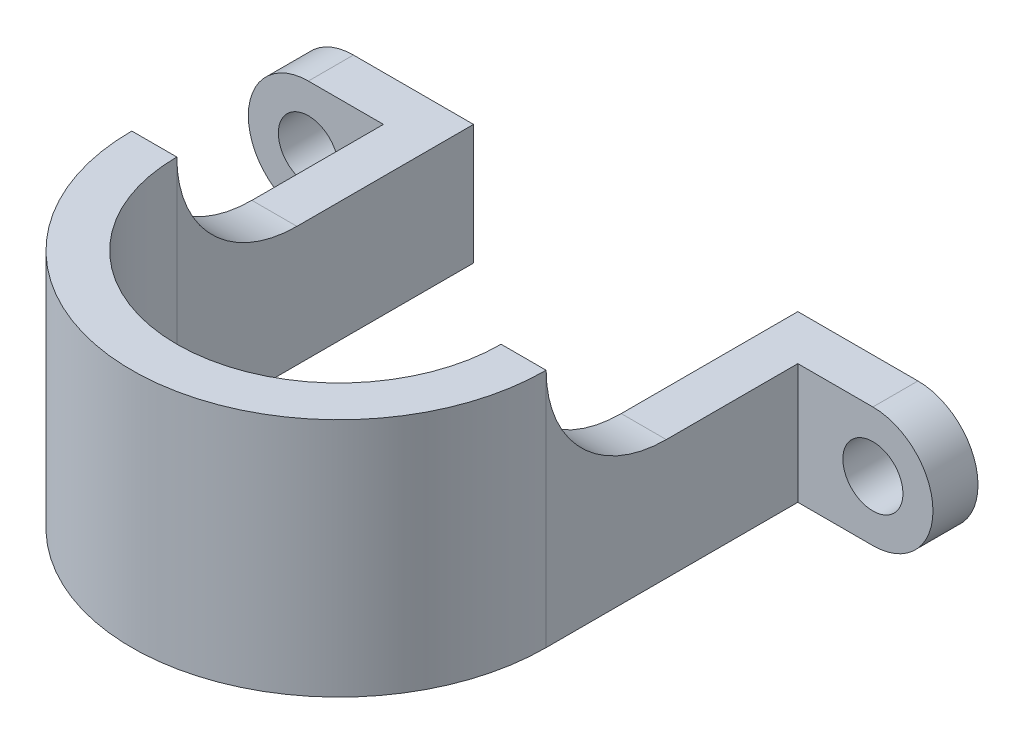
ISO-10303-21;
HEADER;
FILE_DESCRIPTION(('STEP AP214'),'2;1');
FILE_NAME('part.step','',(''),(''),'','','');
FILE_SCHEMA(('AUTOMOTIVE_DESIGN { 1 0 10303 214 1 1 1 1 }'));
ENDSEC;
DATA;
#1=APPLICATION_CONTEXT('core data for automotive mechanical design processes');
#2=APPLICATION_PROTOCOL_DEFINITION('international standard','automotive_design',2000,#1);
#3=PRODUCT_CONTEXT('',#1,'mechanical');
#4=PRODUCT('Part','Part','',(#3));
#5=PRODUCT_RELATED_PRODUCT_CATEGORY('part','',(#4));
#6=PRODUCT_DEFINITION_FORMATION('','',#4);
#7=PRODUCT_DEFINITION_CONTEXT('part definition',#1,'design');
#8=PRODUCT_DEFINITION('design','',#6,#7);
#9=PRODUCT_DEFINITION_SHAPE('','',#8);
#10=(LENGTH_UNIT() NAMED_UNIT(*) SI_UNIT(.MILLI.,.METRE.));
#11=(NAMED_UNIT(*) PLANE_ANGLE_UNIT() SI_UNIT($,.RADIAN.));
#12=(NAMED_UNIT(*) SI_UNIT($,.STERADIAN.) SOLID_ANGLE_UNIT());
#13=UNCERTAINTY_MEASURE_WITH_UNIT(LENGTH_MEASURE(1.E-05),#10,'distance_accuracy_value','');
#14=(GEOMETRIC_REPRESENTATION_CONTEXT(3) GLOBAL_UNCERTAINTY_ASSIGNED_CONTEXT((#13)) GLOBAL_UNIT_ASSIGNED_CONTEXT((#10,
#11,#12)) REPRESENTATION_CONTEXT('',''));
#15=CARTESIAN_POINT('',(0.,0.,0.));
#16=DIRECTION('',(0.,0.,1.));
#17=DIRECTION('',(1.,0.,0.));
#18=AXIS2_PLACEMENT_3D('',#15,#16,#17);
#19=CARTESIAN_POINT('',(366.113193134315,988.729361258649,1255.11303447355));
#20=DIRECTION('',(0.,1.,0.));
#21=DIRECTION('',(-1.,0.,0.));
#22=AXIS2_PLACEMENT_3D('',#19,#20,#21);
#23=PLANE('',#22);
#24=DIRECTION('',(0.,0.,-1.));
#25=VECTOR('',#24,1.);
#26=CARTESIAN_POINT('',(361.350693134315,988.729361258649,1255.11303447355));
#27=LINE('',#26,#25);
#28=CARTESIAN_POINT('',(361.350693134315,988.729361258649,1273.78711447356));
#29=VERTEX_POINT('',#28);
#30=CARTESIAN_POINT('',(361.350693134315,988.729361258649,1259.87553447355));
#31=VERTEX_POINT('',#30);
#32=EDGE_CURVE('E250',#29,#31,#27,.T.);
#33=ORIENTED_EDGE('',*,*,#32,.F.);
#34=DIRECTION('',(-1.,0.,0.));
#35=VECTOR('',#34,1.);
#36=CARTESIAN_POINT('',(366.113193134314,988.729361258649,1273.78711447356));
#37=LINE('',#36,#35);
#38=CARTESIAN_POINT('',(366.113193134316,988.729361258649,1273.78711447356));
#39=VERTEX_POINT('',#38);
#40=EDGE_CURVE('E155',#29,#39,#37,.F.);
#41=ORIENTED_EDGE('',*,*,#40,.T.);
#42=DIRECTION('',(0.,0.,1.));
#43=VECTOR('',#42,1.);
#44=CARTESIAN_POINT('',(366.113193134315,988.729361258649,1255.11303447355));
#45=LINE('',#44,#43);
#46=CARTESIAN_POINT('',(366.113193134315,988.729361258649,1255.11303447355));
#47=VERTEX_POINT('',#46);
#48=EDGE_CURVE('E221',#47,#39,#45,.T.);
#49=ORIENTED_EDGE('',*,*,#48,.F.);
#50=DIRECTION('',(1.,0.,0.));
#51=VECTOR('',#50,1.);
#52=CARTESIAN_POINT('',(366.113193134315,988.729361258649,1255.11303447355));
#53=LINE('',#52,#51);
#54=CARTESIAN_POINT('',(353.413193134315,988.729361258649,1255.11303447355));
#55=VERTEX_POINT('',#54);
#56=EDGE_CURVE('E246',#55,#47,#53,.T.);
#57=ORIENTED_EDGE('',*,*,#56,.F.);
#58=DIRECTION('',(0.,0.,-1.));
#59=VECTOR('',#58,1.);
#60=CARTESIAN_POINT('',(353.413193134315,988.729361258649,1259.87553447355));
#61=LINE('',#60,#59);
#62=CARTESIAN_POINT('',(353.413193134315,988.729361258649,1259.87553447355));
#63=VERTEX_POINT('',#62);
#64=EDGE_CURVE('E196',#63,#55,#61,.T.);
#65=ORIENTED_EDGE('',*,*,#64,.F.);
#66=DIRECTION('',(-1.,0.,0.));
#67=VECTOR('',#66,1.);
#68=CARTESIAN_POINT('',(361.350693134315,988.729361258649,1259.87553447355));
#69=LINE('',#68,#67);
#70=EDGE_CURVE('E184',#31,#63,#69,.T.);
#71=ORIENTED_EDGE('',*,*,#70,.F.);
#72=EDGE_LOOP('',(#33,#41,#49,#57,#65,#71));
#73=FACE_BOUND('',#72,.T.);
#74=ADVANCED_FACE('F39',(#73),#23,.T.);
#75=DIRECTION('',(0.,0.,-1.));
#76=VECTOR('',#75,1.);
#77=CARTESIAN_POINT('',(400.403193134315,988.729361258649,1286.48711447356));
#78=LINE('',#77,#76);
#79=CARTESIAN_POINT('',(400.403193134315,988.729361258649,1273.78711447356));
#80=VERTEX_POINT('',#79);
#81=CARTESIAN_POINT('',(400.403193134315,988.729361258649,1255.11303447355));
#82=VERTEX_POINT('',#81);
#83=EDGE_CURVE('E146',#80,#82,#78,.T.);
#84=ORIENTED_EDGE('',*,*,#83,.F.);
#85=DIRECTION('',(-1.,0.,0.));
#86=VECTOR('',#85,1.);
#87=CARTESIAN_POINT('',(366.113193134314,988.729361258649,1273.78711447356));
#88=LINE('',#87,#86);
#89=CARTESIAN_POINT('',(405.165693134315,988.729361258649,1273.78711447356));
#90=VERTEX_POINT('',#89);
#91=EDGE_CURVE('E142',#80,#90,#88,.F.);
#92=ORIENTED_EDGE('',*,*,#91,.T.);
#93=DIRECTION('',(0.,0.,1.));
#94=VECTOR('',#93,1.);
#95=CARTESIAN_POINT('',(405.165693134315,988.729361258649,1255.11303447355));
#96=LINE('',#95,#94);
#97=CARTESIAN_POINT('',(405.165693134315,988.729361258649,1259.87553447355));
#98=VERTEX_POINT('',#97);
#99=EDGE_CURVE('E144',#98,#90,#96,.T.);
#100=ORIENTED_EDGE('',*,*,#99,.F.);
#101=DIRECTION('',(-1.,0.,0.));
#102=VECTOR('',#101,1.);
#103=CARTESIAN_POINT('',(405.165693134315,988.729361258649,1259.87553447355));
#104=LINE('',#103,#102);
#105=CARTESIAN_POINT('',(413.103193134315,988.729361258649,1259.87553447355));
#106=VERTEX_POINT('',#105);
#107=EDGE_CURVE('E212',#106,#98,#104,.T.);
#108=ORIENTED_EDGE('',*,*,#107,.F.);
#109=DIRECTION('',(0.,0.,-1.));
#110=VECTOR('',#109,1.);
#111=CARTESIAN_POINT('',(413.103193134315,988.729361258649,1259.87553447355));
#112=LINE('',#111,#110);
#113=CARTESIAN_POINT('',(413.103193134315,988.729361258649,1255.11303447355));
#114=VERTEX_POINT('',#113);
#115=EDGE_CURVE('E175',#106,#114,#112,.T.);
#116=ORIENTED_EDGE('',*,*,#115,.T.);
#117=DIRECTION('',(1.,0.,0.));
#118=VECTOR('',#117,1.);
#119=CARTESIAN_POINT('',(400.403193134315,988.729361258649,1255.11303447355));
#120=LINE('',#119,#118);
#121=EDGE_CURVE('E158',#82,#114,#120,.T.);
#122=ORIENTED_EDGE('',*,*,#121,.F.);
#123=EDGE_LOOP('',(#84,#92,#100,#108,#116,#122));
#124=FACE_BOUND('',#123,.T.);
#125=ADVANCED_FACE('F145',(#124),#23,.T.);
#126=CARTESIAN_POINT('',(383.258193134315,976.029361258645,1286.48711447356));
#127=DIRECTION('',(0.,1.,0.));
#128=DIRECTION('',(-1.,0.,0.));
#129=AXIS2_PLACEMENT_3D('',#126,#127,#128);
#130=PLANE('',#129);
#131=DIRECTION('',(1.,0.,0.));
#132=VECTOR('',#131,1.);
#133=CARTESIAN_POINT('',(366.113193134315,976.029361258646,1255.11303447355));
#134=LINE('',#133,#132);
#135=CARTESIAN_POINT('',(353.413193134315,976.029361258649,1255.11303447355));
#136=VERTEX_POINT('',#135);
#137=CARTESIAN_POINT('',(366.113193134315,976.029361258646,1255.11303447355));
#138=VERTEX_POINT('',#137);
#139=EDGE_CURVE('E203',#136,#138,#134,.T.);
#140=ORIENTED_EDGE('',*,*,#139,.T.);
#141=DIRECTION('',(0.,0.,1.));
#142=VECTOR('',#141,1.);
#143=CARTESIAN_POINT('',(366.113193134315,976.029361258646,1255.11303447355));
#144=LINE('',#143,#142);
#145=CARTESIAN_POINT('',(366.113193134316,976.029361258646,1286.48711447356));
#146=VERTEX_POINT('',#145);
#147=EDGE_CURVE('E239',#138,#146,#144,.T.);
#148=ORIENTED_EDGE('',*,*,#147,.T.);
#149=CARTESIAN_POINT('',(383.258193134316,976.029361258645,1286.48711447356));
#150=DIRECTION('',(0.,1.,0.));
#151=DIRECTION('',(1.,0.,0.));
#152=AXIS2_PLACEMENT_3D('',#149,#150,#151);
#153=CIRCLE('',#152,17.1449999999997);
#154=CARTESIAN_POINT('',(400.403193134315,976.029361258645,1286.48711447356));
#155=VERTEX_POINT('',#154);
#156=EDGE_CURVE('E237',#146,#155,#153,.T.);
#157=ORIENTED_EDGE('',*,*,#156,.T.);
#158=DIRECTION('',(0.,0.,-1.));
#159=VECTOR('',#158,1.);
#160=CARTESIAN_POINT('',(400.403193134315,976.029361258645,1286.48711447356));
#161=LINE('',#160,#159);
#162=CARTESIAN_POINT('',(400.403193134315,976.029361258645,1255.11303447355));
#163=VERTEX_POINT('',#162);
#164=EDGE_CURVE('E234',#155,#163,#161,.T.);
#165=ORIENTED_EDGE('',*,*,#164,.T.);
#166=DIRECTION('',(1.,0.,0.));
#167=VECTOR('',#166,1.);
#168=CARTESIAN_POINT('',(400.403193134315,976.029361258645,1255.11303447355));
#169=LINE('',#168,#167);
#170=CARTESIAN_POINT('',(413.103193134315,976.029361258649,1255.11303447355));
#171=VERTEX_POINT('',#170);
#172=EDGE_CURVE('E226',#163,#171,#169,.T.);
#173=ORIENTED_EDGE('',*,*,#172,.T.);
#174=DIRECTION('',(0.,0.,-1.));
#175=VECTOR('',#174,1.);
#176=CARTESIAN_POINT('',(413.103193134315,976.029361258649,1259.87553447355));
#177=LINE('',#176,#175);
#178=CARTESIAN_POINT('',(413.103193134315,976.029361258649,1259.87553447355));
#179=VERTEX_POINT('',#178);
#180=EDGE_CURVE('E204',#179,#171,#177,.T.);
#181=ORIENTED_EDGE('',*,*,#180,.F.);
#182=DIRECTION('',(1.,4.19611851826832E-13,0.));
#183=VECTOR('',#182,1.);
#184=CARTESIAN_POINT('',(413.103193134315,976.029361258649,1259.87553447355));
#185=LINE('',#184,#183);
#186=CARTESIAN_POINT('',(405.165693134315,976.029361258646,1259.87553447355));
#187=VERTEX_POINT('',#186);
#188=EDGE_CURVE('E95',#187,#179,#185,.T.);
#189=ORIENTED_EDGE('',*,*,#188,.F.);
#190=DIRECTION('',(0.,0.,1.));
#191=VECTOR('',#190,1.);
#192=CARTESIAN_POINT('',(405.165693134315,976.029361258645,1255.11303447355));
#193=LINE('',#192,#191);
#194=CARTESIAN_POINT('',(405.165693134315,976.029361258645,1286.48711447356));
#195=VERTEX_POINT('',#194);
#196=EDGE_CURVE('E228',#187,#195,#193,.T.);
#197=ORIENTED_EDGE('',*,*,#196,.T.);
#198=CARTESIAN_POINT('',(383.258193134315,976.029361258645,1286.48711447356));
#199=DIRECTION('',(0.,-1.,0.));
#200=DIRECTION('',(-1.,0.,0.));
#201=AXIS2_PLACEMENT_3D('',#198,#199,#200);
#202=CIRCLE('',#201,21.9075);
#203=CARTESIAN_POINT('',(361.350693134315,976.029361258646,1286.48711447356));
#204=VERTEX_POINT('',#203);
#205=EDGE_CURVE('E223',#195,#204,#202,.T.);
#206=ORIENTED_EDGE('',*,*,#205,.T.);
#207=DIRECTION('',(0.,0.,-1.));
#208=VECTOR('',#207,1.);
#209=CARTESIAN_POINT('',(361.350693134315,976.029361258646,1255.11303447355));
#210=LINE('',#209,#208);
#211=CARTESIAN_POINT('',(361.350693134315,976.029361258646,1259.87553447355));
#212=VERTEX_POINT('',#211);
#213=EDGE_CURVE('E222',#204,#212,#210,.T.);
#214=ORIENTED_EDGE('',*,*,#213,.T.);
#215=DIRECTION('',(1.,-4.19611851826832E-13,0.));
#216=VECTOR('',#215,1.);
#217=CARTESIAN_POINT('',(353.413193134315,976.029361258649,1259.87553447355));
#218=LINE('',#217,#216);
#219=CARTESIAN_POINT('',(353.413193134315,976.029361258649,1259.87553447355));
#220=VERTEX_POINT('',#219);
#221=EDGE_CURVE('E186',#220,#212,#218,.T.);
#222=ORIENTED_EDGE('',*,*,#221,.F.);
#223=DIRECTION('',(0.,0.,-1.));
#224=VECTOR('',#223,1.);
#225=CARTESIAN_POINT('',(353.413193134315,976.029361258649,1259.87553447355));
#226=LINE('',#225,#224);
#227=EDGE_CURVE('E194',#220,#136,#226,.T.);
#228=ORIENTED_EDGE('',*,*,#227,.T.);
#229=EDGE_LOOP('',(#140,#148,#157,#165,#173,#181,#189,#197,#206,#214,#222,#228));
#230=FACE_BOUND('',#229,.T.);
#231=ADVANCED_FACE('F277',(#230),#130,.F.);
#232=CARTESIAN_POINT('',(366.113193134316,1057.71255480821,1255.11303447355));
#233=DIRECTION('',(1.,0.,0.));
#234=DIRECTION('',(0.,0.,-1.));
#235=AXIS2_PLACEMENT_3D('',#232,#233,#234);
#236=PLANE('',#235);
#237=DIRECTION('',(0.,-1.,0.));
#238=VECTOR('',#237,1.);
#239=CARTESIAN_POINT('',(366.113193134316,1057.71255480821,1255.11303447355));
#240=LINE('',#239,#238);
#241=EDGE_CURVE('E248',#47,#138,#240,.T.);
#242=ORIENTED_EDGE('',*,*,#241,.F.);
#243=ORIENTED_EDGE('',*,*,#48,.T.);
#244=CARTESIAN_POINT('',(366.113193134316,1001.42936125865,1273.78711447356));
#245=DIRECTION('',(1.,0.,0.));
#246=DIRECTION('',(0.,0.,-1.));
#247=AXIS2_PLACEMENT_3D('',#244,#245,#246);
#248=CIRCLE('',#247,12.7);
#249=CARTESIAN_POINT('',(366.113193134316,1001.42936125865,1286.48711447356));
#250=VERTEX_POINT('',#249);
#251=EDGE_CURVE('E264',#39,#250,#248,.F.);
#252=ORIENTED_EDGE('',*,*,#251,.T.);
#253=DIRECTION('',(0.,-1.,0.));
#254=VECTOR('',#253,1.);
#255=CARTESIAN_POINT('',(366.113193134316,1057.71255480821,1286.48711447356));
#256=LINE('',#255,#254);
#257=EDGE_CURVE('E63',#250,#146,#256,.T.);
#258=ORIENTED_EDGE('',*,*,#257,.T.);
#259=ORIENTED_EDGE('',*,*,#147,.F.);
#260=EDGE_LOOP('',(#242,#243,#252,#258,#259));
#261=FACE_BOUND('',#260,.T.);
#262=ADVANCED_FACE('F284',(#261),#236,.T.);
#263=CARTESIAN_POINT('',(383.258193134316,1057.71255480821,1286.48711447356));
#264=DIRECTION('',(0.,-1.,0.));
#265=DIRECTION('',(1.,0.,0.));
#266=AXIS2_PLACEMENT_3D('',#263,#264,#265);
#267=CYLINDRICAL_SURFACE('',#266,17.1449999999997);
#268=ORIENTED_EDGE('',*,*,#257,.F.);
#269=CARTESIAN_POINT('',(383.258193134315,1001.42936125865,1286.48711447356));
#270=DIRECTION('',(0.,-1.,0.));
#271=DIRECTION('',(0.,0.,-1.));
#272=AXIS2_PLACEMENT_3D('',#269,#270,#271);
#273=CIRCLE('',#272,17.1449999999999);
#274=CARTESIAN_POINT('',(400.403193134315,1001.42936125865,1286.48711447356));
#275=VERTEX_POINT('',#274);
#276=EDGE_CURVE('E162',#275,#250,#273,.T.);
#277=ORIENTED_EDGE('',*,*,#276,.F.);
#278=DIRECTION('',(0.,-1.,0.));
#279=VECTOR('',#278,1.);
#280=CARTESIAN_POINT('',(400.403193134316,1057.71255480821,1286.48711447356));
#281=LINE('',#280,#279);
#282=EDGE_CURVE('E73',#275,#155,#281,.T.);
#283=ORIENTED_EDGE('',*,*,#282,.T.);
#284=ORIENTED_EDGE('',*,*,#156,.F.);
#285=EDGE_LOOP('',(#268,#277,#283,#284));
#286=FACE_BOUND('',#285,.T.);
#287=ADVANCED_FACE('F279',(#286),#267,.F.);
#288=CARTESIAN_POINT('',(400.403193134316,1057.71255480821,1286.48711447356));
#289=DIRECTION('',(-1.,0.,0.));
#290=DIRECTION('',(0.,-1.,0.));
#291=AXIS2_PLACEMENT_3D('',#288,#289,#290);
#292=PLANE('',#291);
#293=ORIENTED_EDGE('',*,*,#282,.F.);
#294=CARTESIAN_POINT('',(400.403193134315,1001.42936125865,1273.78711447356));
#295=DIRECTION('',(-1.,0.,0.));
#296=DIRECTION('',(0.,-1.,0.));
#297=AXIS2_PLACEMENT_3D('',#294,#295,#296);
#298=CIRCLE('',#297,12.7);
#299=EDGE_CURVE('E50',#275,#80,#298,.F.);
#300=ORIENTED_EDGE('',*,*,#299,.T.);
#301=ORIENTED_EDGE('',*,*,#83,.T.);
#302=DIRECTION('',(0.,-1.,0.));
#303=VECTOR('',#302,1.);
#304=CARTESIAN_POINT('',(400.403193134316,1057.71255480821,1255.11303447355));
#305=LINE('',#304,#303);
#306=EDGE_CURVE('E254',#82,#163,#305,.T.);
#307=ORIENTED_EDGE('',*,*,#306,.T.);
#308=ORIENTED_EDGE('',*,*,#164,.F.);
#309=EDGE_LOOP('',(#293,#300,#301,#307,#308));
#310=FACE_BOUND('',#309,.T.);
#311=ADVANCED_FACE('F270',(#310),#292,.T.);
#312=CARTESIAN_POINT('',(400.403193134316,1057.71255480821,1255.11303447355));
#313=DIRECTION('',(0.,0.,-1.));
#314=DIRECTION('',(0.,1.,0.));
#315=AXIS2_PLACEMENT_3D('',#312,#313,#314);
#316=PLANE('',#315);
#317=ORIENTED_EDGE('',*,*,#306,.F.);
#318=ORIENTED_EDGE('',*,*,#121,.T.);
#319=CARTESIAN_POINT('',(413.103193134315,982.379361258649,1255.11303447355));
#320=DIRECTION('',(0.,0.,1.));
#321=DIRECTION('',(-1.,0.,0.));
#322=AXIS2_PLACEMENT_3D('',#319,#320,#321);
#323=CIRCLE('',#322,6.35000000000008);
#324=EDGE_CURVE('E210',#171,#114,#323,.T.);
#325=ORIENTED_EDGE('',*,*,#324,.F.);
#326=ORIENTED_EDGE('',*,*,#172,.F.);
#327=EDGE_LOOP('',(#317,#318,#325,#326));
#328=FACE_BOUND('',#327,.T.);
#329=CARTESIAN_POINT('',(413.103193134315,982.379361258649,1255.11303447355));
#330=DIRECTION('',(0.,0.,1.));
#331=DIRECTION('',(-1.,0.,0.));
#332=AXIS2_PLACEMENT_3D('',#329,#330,#331);
#333=CIRCLE('',#332,3.17499999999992);
#334=CARTESIAN_POINT('',(409.928193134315,982.379361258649,1255.11303447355));
#335=VERTEX_POINT('',#334);
#336=EDGE_CURVE('E180',#335,#335,#333,.T.);
#337=ORIENTED_EDGE('',*,*,#336,.T.);
#338=EDGE_LOOP('',(#337));
#339=FACE_BOUND('',#338,.T.);
#340=ADVANCED_FACE('F272',(#328,#339),#316,.T.);
#341=CARTESIAN_POINT('',(405.165693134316,1057.71255480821,1255.11303447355));
#342=DIRECTION('',(1.,0.,0.));
#343=DIRECTION('',(0.,1.,0.));
#344=AXIS2_PLACEMENT_3D('',#341,#342,#343);
#345=PLANE('',#344);
#346=DIRECTION('',(0.,-1.,0.));
#347=VECTOR('',#346,1.);
#348=CARTESIAN_POINT('',(405.165693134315,976.029361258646,1259.87553447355));
#349=LINE('',#348,#347);
#350=EDGE_CURVE('E160',#98,#187,#349,.T.);
#351=ORIENTED_EDGE('',*,*,#350,.F.);
#352=ORIENTED_EDGE('',*,*,#99,.T.);
#353=CARTESIAN_POINT('',(405.165693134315,1001.42936125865,1273.78711447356));
#354=DIRECTION('',(1.,0.,0.));
#355=DIRECTION('',(0.,1.,0.));
#356=AXIS2_PLACEMENT_3D('',#353,#354,#355);
#357=CIRCLE('',#356,12.7);
#358=CARTESIAN_POINT('',(405.165693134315,1001.42936125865,1286.48711447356));
#359=VERTEX_POINT('',#358);
#360=EDGE_CURVE('E11',#90,#359,#357,.F.);
#361=ORIENTED_EDGE('',*,*,#360,.T.);
#362=DIRECTION('',(0.,-1.,0.));
#363=VECTOR('',#362,1.);
#364=CARTESIAN_POINT('',(405.165693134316,1057.71255480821,1286.48711447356));
#365=LINE('',#364,#363);
#366=EDGE_CURVE('E53',#359,#195,#365,.T.);
#367=ORIENTED_EDGE('',*,*,#366,.T.);
#368=ORIENTED_EDGE('',*,*,#196,.F.);
#369=EDGE_LOOP('',(#351,#352,#361,#367,#368));
#370=FACE_BOUND('',#369,.T.);
#371=ADVANCED_FACE('F154',(#370),#345,.T.);
#372=CARTESIAN_POINT('',(383.258193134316,1057.71255480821,1286.48711447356));
#373=DIRECTION('',(0.,-1.,0.));
#374=DIRECTION('',(1.,0.,0.));
#375=AXIS2_PLACEMENT_3D('',#372,#373,#374);
#376=CYLINDRICAL_SURFACE('',#375,21.9075);
#377=ORIENTED_EDGE('',*,*,#366,.F.);
#378=CARTESIAN_POINT('',(383.258193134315,1001.42936125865,1286.48711447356));
#379=DIRECTION('',(0.,1.,0.));
#380=DIRECTION('',(0.,0.,-1.));
#381=AXIS2_PLACEMENT_3D('',#378,#379,#380);
#382=CIRCLE('',#381,21.9075);
#383=CARTESIAN_POINT('',(361.350693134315,1001.42936125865,1286.48711447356));
#384=VERTEX_POINT('',#383);
#385=EDGE_CURVE('E163',#384,#359,#382,.T.);
#386=ORIENTED_EDGE('',*,*,#385,.F.);
#387=DIRECTION('',(0.,-1.,0.));
#388=VECTOR('',#387,1.);
#389=CARTESIAN_POINT('',(361.350693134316,1057.71255480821,1286.48711447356));
#390=LINE('',#389,#388);
#391=EDGE_CURVE('E84',#384,#204,#390,.T.);
#392=ORIENTED_EDGE('',*,*,#391,.T.);
#393=ORIENTED_EDGE('',*,*,#205,.F.);
#394=EDGE_LOOP('',(#377,#386,#392,#393));
#395=FACE_BOUND('',#394,.T.);
#396=ADVANCED_FACE('F304',(#395),#376,.T.);
#397=CARTESIAN_POINT('',(361.350693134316,1057.71255480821,1255.11303447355));
#398=DIRECTION('',(-1.,0.,0.));
#399=DIRECTION('',(0.,-1.,0.));
#400=AXIS2_PLACEMENT_3D('',#397,#398,#399);
#401=PLANE('',#400);
#402=DIRECTION('',(0.,1.,0.));
#403=VECTOR('',#402,1.);
#404=CARTESIAN_POINT('',(361.350693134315,976.029361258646,1259.87553447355));
#405=LINE('',#404,#403);
#406=EDGE_CURVE('E182',#212,#31,#405,.T.);
#407=ORIENTED_EDGE('',*,*,#406,.F.);
#408=ORIENTED_EDGE('',*,*,#213,.F.);
#409=ORIENTED_EDGE('',*,*,#391,.F.);
#410=CARTESIAN_POINT('',(361.350693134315,1001.42936125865,1273.78711447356));
#411=DIRECTION('',(-1.,0.,0.));
#412=DIRECTION('',(0.,-1.,0.));
#413=AXIS2_PLACEMENT_3D('',#410,#411,#412);
#414=CIRCLE('',#413,12.7);
#415=EDGE_CURVE('E151',#384,#29,#414,.F.);
#416=ORIENTED_EDGE('',*,*,#415,.T.);
#417=ORIENTED_EDGE('',*,*,#32,.T.);
#418=EDGE_LOOP('',(#407,#408,#409,#416,#417));
#419=FACE_BOUND('',#418,.T.);
#420=ADVANCED_FACE('F288',(#419),#401,.T.);
#421=CARTESIAN_POINT('',(366.113193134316,1057.71255480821,1255.11303447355));
#422=DIRECTION('',(0.,0.,-1.));
#423=DIRECTION('',(0.,1.,0.));
#424=AXIS2_PLACEMENT_3D('',#421,#422,#423);
#425=PLANE('',#424);
#426=ORIENTED_EDGE('',*,*,#139,.F.);
#427=CARTESIAN_POINT('',(353.413193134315,982.379361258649,1255.11303447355));
#428=DIRECTION('',(0.,0.,1.));
#429=DIRECTION('',(1.,0.,0.));
#430=AXIS2_PLACEMENT_3D('',#427,#428,#429);
#431=CIRCLE('',#430,6.35000000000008);
#432=EDGE_CURVE('E176',#55,#136,#431,.T.);
#433=ORIENTED_EDGE('',*,*,#432,.F.);
#434=ORIENTED_EDGE('',*,*,#56,.T.);
#435=ORIENTED_EDGE('',*,*,#241,.T.);
#436=EDGE_LOOP('',(#426,#433,#434,#435));
#437=FACE_BOUND('',#436,.T.);
#438=CARTESIAN_POINT('',(353.413193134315,982.379361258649,1255.11303447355));
#439=DIRECTION('',(0.,0.,1.));
#440=DIRECTION('',(1.,0.,0.));
#441=AXIS2_PLACEMENT_3D('',#438,#439,#440);
#442=CIRCLE('',#441,3.17499999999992);
#443=CARTESIAN_POINT('',(350.238193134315,982.379361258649,1255.11303447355));
#444=VERTEX_POINT('',#443);
#445=EDGE_CURVE('E177',#444,#444,#442,.T.);
#446=ORIENTED_EDGE('',*,*,#445,.T.);
#447=EDGE_LOOP('',(#446));
#448=FACE_BOUND('',#447,.T.);
#449=ADVANCED_FACE('F309',(#437,#448),#425,.T.);
#450=CARTESIAN_POINT('',(353.413193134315,982.379361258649,1259.87553447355));
#451=DIRECTION('',(0.,0.,1.));
#452=DIRECTION('',(1.,0.,0.));
#453=AXIS2_PLACEMENT_3D('',#450,#451,#452);
#454=PLANE('',#453);
#455=ORIENTED_EDGE('',*,*,#406,.T.);
#456=ORIENTED_EDGE('',*,*,#70,.T.);
#457=CARTESIAN_POINT('',(353.413193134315,982.379361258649,1259.87553447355));
#458=DIRECTION('',(0.,0.,1.));
#459=DIRECTION('',(1.,0.,0.));
#460=AXIS2_PLACEMENT_3D('',#457,#458,#459);
#461=CIRCLE('',#460,6.35000000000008);
#462=EDGE_CURVE('E190',#63,#220,#461,.T.);
#463=ORIENTED_EDGE('',*,*,#462,.T.);
#464=ORIENTED_EDGE('',*,*,#221,.T.);
#465=EDGE_LOOP('',(#455,#456,#463,#464));
#466=FACE_BOUND('',#465,.T.);
#467=CARTESIAN_POINT('',(353.413193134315,982.379361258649,1259.87553447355));
#468=DIRECTION('',(0.,0.,1.));
#469=DIRECTION('',(1.,0.,0.));
#470=AXIS2_PLACEMENT_3D('',#467,#468,#469);
#471=CIRCLE('',#470,3.17499999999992);
#472=CARTESIAN_POINT('',(350.238193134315,982.379361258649,1259.87553447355));
#473=VERTEX_POINT('',#472);
#474=EDGE_CURVE('E173',#473,#473,#471,.T.);
#475=ORIENTED_EDGE('',*,*,#474,.F.);
#476=EDGE_LOOP('',(#475));
#477=FACE_BOUND('',#476,.T.);
#478=ADVANCED_FACE('F296',(#466,#477),#454,.T.);
#479=CARTESIAN_POINT('',(353.413193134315,982.379361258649,1259.87553447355));
#480=DIRECTION('',(0.,0.,-1.));
#481=DIRECTION('',(-1.,0.,0.));
#482=AXIS2_PLACEMENT_3D('',#479,#480,#481);
#483=CYLINDRICAL_SURFACE('',#482,6.35000000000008);
#484=ORIENTED_EDGE('',*,*,#432,.T.);
#485=ORIENTED_EDGE('',*,*,#227,.F.);
#486=ORIENTED_EDGE('',*,*,#462,.F.);
#487=ORIENTED_EDGE('',*,*,#64,.T.);
#488=EDGE_LOOP('',(#484,#485,#486,#487));
#489=FACE_BOUND('',#488,.T.);
#490=ADVANCED_FACE('F338',(#489),#483,.T.);
#491=CARTESIAN_POINT('',(353.413193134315,982.379361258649,1259.87553447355));
#492=DIRECTION('',(0.,0.,-1.));
#493=DIRECTION('',(-1.,0.,0.));
#494=AXIS2_PLACEMENT_3D('',#491,#492,#493);
#495=CYLINDRICAL_SURFACE('',#494,3.17499999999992);
#496=CARTESIAN_POINT('',(350.238193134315,982.379361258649,1259.87553447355));
#497=CARTESIAN_POINT('',(350.238193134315,982.379361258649,1259.82592509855));
#498=CARTESIAN_POINT('',(350.238193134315,982.379361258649,1259.77631572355));
#499=CARTESIAN_POINT('',(350.238193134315,982.379361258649,1259.67709697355));
#500=CARTESIAN_POINT('',(350.238193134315,982.379361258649,1259.62748759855));
#501=CARTESIAN_POINT('',(350.238193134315,982.379361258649,1259.52826884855));
#502=CARTESIAN_POINT('',(350.238193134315,982.379361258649,1259.47865947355));
#503=CARTESIAN_POINT('',(350.238193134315,982.379361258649,1259.37944072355));
#504=CARTESIAN_POINT('',(350.238193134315,982.379361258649,1259.32983134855));
#505=CARTESIAN_POINT('',(350.238193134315,982.379361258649,1259.23061259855));
#506=CARTESIAN_POINT('',(350.238193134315,982.379361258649,1259.18100322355));
#507=CARTESIAN_POINT('',(350.238193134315,982.379361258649,1259.08178447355));
#508=CARTESIAN_POINT('',(350.238193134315,982.379361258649,1259.03217509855));
#509=CARTESIAN_POINT('',(350.238193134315,982.379361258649,1258.93295634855));
#510=CARTESIAN_POINT('',(350.238193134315,982.379361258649,1258.88334697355));
#511=CARTESIAN_POINT('',(350.238193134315,982.379361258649,1258.78412822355));
#512=CARTESIAN_POINT('',(350.238193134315,982.379361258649,1258.73451884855));
#513=CARTESIAN_POINT('',(350.238193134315,982.379361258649,1258.63530009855));
#514=CARTESIAN_POINT('',(350.238193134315,982.379361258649,1258.58569072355));
#515=CARTESIAN_POINT('',(350.238193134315,982.379361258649,1258.48647197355));
#516=CARTESIAN_POINT('',(350.238193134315,982.379361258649,1258.43686259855));
#517=CARTESIAN_POINT('',(350.238193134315,982.379361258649,1258.33764384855));
#518=CARTESIAN_POINT('',(350.238193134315,982.379361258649,1258.28803447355));
#519=CARTESIAN_POINT('',(350.238193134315,982.379361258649,1258.18881572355));
#520=CARTESIAN_POINT('',(350.238193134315,982.379361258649,1258.13920634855));
#521=CARTESIAN_POINT('',(350.238193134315,982.379361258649,1258.03998759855));
#522=CARTESIAN_POINT('',(350.238193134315,982.379361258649,1257.99037822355));
#523=CARTESIAN_POINT('',(350.238193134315,982.379361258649,1257.89115947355));
#524=CARTESIAN_POINT('',(350.238193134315,982.379361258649,1257.84155009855));
#525=CARTESIAN_POINT('',(350.238193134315,982.379361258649,1257.74233134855));
#526=CARTESIAN_POINT('',(350.238193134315,982.379361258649,1257.69272197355));
#527=CARTESIAN_POINT('',(350.238193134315,982.379361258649,1257.59350322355));
#528=CARTESIAN_POINT('',(350.238193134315,982.379361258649,1257.54389384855));
#529=CARTESIAN_POINT('',(350.238193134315,982.379361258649,1257.44467509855));
#530=CARTESIAN_POINT('',(350.238193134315,982.379361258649,1257.39506572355));
#531=CARTESIAN_POINT('',(350.238193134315,982.379361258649,1257.29584697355));
#532=CARTESIAN_POINT('',(350.238193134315,982.379361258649,1257.24623759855));
#533=CARTESIAN_POINT('',(350.238193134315,982.379361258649,1257.14701884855));
#534=CARTESIAN_POINT('',(350.238193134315,982.379361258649,1257.09740947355));
#535=CARTESIAN_POINT('',(350.238193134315,982.379361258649,1256.99819072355));
#536=CARTESIAN_POINT('',(350.238193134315,982.379361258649,1256.94858134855));
#537=CARTESIAN_POINT('',(350.238193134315,982.379361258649,1256.84936259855));
#538=CARTESIAN_POINT('',(350.238193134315,982.379361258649,1256.79975322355));
#539=CARTESIAN_POINT('',(350.238193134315,982.379361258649,1256.70053447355));
#540=CARTESIAN_POINT('',(350.238193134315,982.379361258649,1256.65092509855));
#541=CARTESIAN_POINT('',(350.238193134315,982.379361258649,1256.55170634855));
#542=CARTESIAN_POINT('',(350.238193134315,982.379361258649,1256.50209697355));
#543=CARTESIAN_POINT('',(350.238193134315,982.379361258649,1256.40287822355));
#544=CARTESIAN_POINT('',(350.238193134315,982.379361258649,1256.35326884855));
#545=CARTESIAN_POINT('',(350.238193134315,982.379361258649,1256.25405009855));
#546=CARTESIAN_POINT('',(350.238193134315,982.379361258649,1256.20444072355));
#547=CARTESIAN_POINT('',(350.238193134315,982.379361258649,1256.10522197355));
#548=CARTESIAN_POINT('',(350.238193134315,982.379361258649,1256.05561259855));
#549=CARTESIAN_POINT('',(350.238193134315,982.379361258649,1255.95639384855));
#550=CARTESIAN_POINT('',(350.238193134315,982.379361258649,1255.90678447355));
#551=CARTESIAN_POINT('',(350.238193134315,982.379361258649,1255.80756572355));
#552=CARTESIAN_POINT('',(350.238193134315,982.379361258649,1255.75795634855));
#553=CARTESIAN_POINT('',(350.238193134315,982.379361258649,1255.65873759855));
#554=CARTESIAN_POINT('',(350.238193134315,982.379361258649,1255.60912822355));
#555=CARTESIAN_POINT('',(350.238193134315,982.379361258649,1255.50990947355));
#556=CARTESIAN_POINT('',(350.238193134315,982.379361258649,1255.46030009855));
#557=CARTESIAN_POINT('',(350.238193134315,982.379361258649,1255.36108134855));
#558=CARTESIAN_POINT('',(350.238193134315,982.379361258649,1255.31147197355));
#559=CARTESIAN_POINT('',(350.238193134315,982.379361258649,1255.21225322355));
#560=CARTESIAN_POINT('',(350.238193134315,982.379361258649,1255.16264384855));
#561=CARTESIAN_POINT('',(350.238193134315,982.379361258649,1255.11303447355));
#562=B_SPLINE_CURVE_WITH_KNOTS('',3,(#496,#497,#498,#499,#500,#501,#502,#503,#504,#505,#506,
#507,#508,#509,#510,#511,#512,#513,#514,#515,#516,#517,#518,#519,#520,#521,#522,#523,#524,#525,
#526,#527,#528,#529,#530,#531,#532,#533,#534,#535,#536,#537,#538,#539,#540,#541,#542,#543,#544,
#545,#546,#547,#548,#549,#550,#551,#552,#553,#554,#555,#556,#557,#558,#559,#560,#561),
.UNSPECIFIED.,.F.,.F.,(4,2,2,2,2,2,2,2,2,2,2,2,2,2,2,2,2,2,2,2,2,2,2,2,2,2,2,2,2,2,2,2,4),(0.,
0.148828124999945,0.297656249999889,0.446484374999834,0.595312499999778,0.744140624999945,
0.89296874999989,1.04179687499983,1.19062499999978,1.33945312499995,1.48828124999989,
1.63710937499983,1.78593749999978,1.93476562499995,2.08359374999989,2.23242187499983,
2.38124999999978,2.53007812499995,2.67890624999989,2.82773437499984,2.97656249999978,
3.12539062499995,3.27421874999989,3.42304687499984,3.57187499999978,3.72070312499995,
3.86953124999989,4.01835937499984,4.16718749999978,4.31601562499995,4.46484374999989,
4.61367187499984,4.76249999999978),.UNSPECIFIED.);
#563=EDGE_CURVE('BSEAM331',#473,#444,#562,.T.);
#564=ORIENTED_EDGE('',*,*,#474,.T.);
#565=ORIENTED_EDGE('',*,*,#445,.F.);
#566=ORIENTED_EDGE('',*,*,#563,.T.);
#567=ORIENTED_EDGE('',*,*,#563,.F.);
#568=EDGE_LOOP('',(#564,#566,#565,#567));
#569=FACE_BOUND('',#568,.T.);
#570=ADVANCED_FACE('F331',(#569),#495,.F.);
#571=CARTESIAN_POINT('',(413.103193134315,982.379361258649,1259.87553447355));
#572=DIRECTION('',(0.,0.,-1.));
#573=DIRECTION('',(-1.,0.,0.));
#574=AXIS2_PLACEMENT_3D('',#571,#572,#573);
#575=PLANE('',#574);
#576=CARTESIAN_POINT('',(413.103193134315,982.379361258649,1259.87553447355));
#577=DIRECTION('',(0.,0.,1.));
#578=DIRECTION('',(-1.,0.,0.));
#579=AXIS2_PLACEMENT_3D('',#576,#577,#578);
#580=CIRCLE('',#579,6.35000000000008);
#581=EDGE_CURVE('E211',#179,#106,#580,.T.);
#582=ORIENTED_EDGE('',*,*,#581,.T.);
#583=ORIENTED_EDGE('',*,*,#107,.T.);
#584=ORIENTED_EDGE('',*,*,#350,.T.);
#585=ORIENTED_EDGE('',*,*,#188,.T.);
#586=EDGE_LOOP('',(#582,#583,#584,#585));
#587=FACE_BOUND('',#586,.T.);
#588=CARTESIAN_POINT('',(413.103193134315,982.379361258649,1259.87553447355));
#589=DIRECTION('',(0.,0.,1.));
#590=DIRECTION('',(-1.,0.,0.));
#591=AXIS2_PLACEMENT_3D('',#588,#589,#590);
#592=CIRCLE('',#591,3.17499999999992);
#593=CARTESIAN_POINT('',(409.928193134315,982.379361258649,1259.87553447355));
#594=VERTEX_POINT('',#593);
#595=EDGE_CURVE('E209',#594,#594,#592,.T.);
#596=ORIENTED_EDGE('',*,*,#595,.F.);
#597=EDGE_LOOP('',(#596));
#598=FACE_BOUND('',#597,.T.);
#599=ADVANCED_FACE('F340',(#587,#598),#575,.F.);
#600=CARTESIAN_POINT('',(413.103193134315,982.379361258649,1259.87553447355));
#601=DIRECTION('',(0.,0.,-1.));
#602=DIRECTION('',(-1.,0.,0.));
#603=AXIS2_PLACEMENT_3D('',#600,#601,#602);
#604=CYLINDRICAL_SURFACE('',#603,6.35000000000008);
#605=ORIENTED_EDGE('',*,*,#324,.T.);
#606=ORIENTED_EDGE('',*,*,#115,.F.);
#607=ORIENTED_EDGE('',*,*,#581,.F.);
#608=ORIENTED_EDGE('',*,*,#180,.T.);
#609=EDGE_LOOP('',(#605,#606,#607,#608));
#610=FACE_BOUND('',#609,.T.);
#611=ADVANCED_FACE('F329',(#610),#604,.T.);
#612=CARTESIAN_POINT('',(413.103193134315,982.379361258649,1259.87553447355));
#613=DIRECTION('',(0.,0.,-1.));
#614=DIRECTION('',(-1.,0.,0.));
#615=AXIS2_PLACEMENT_3D('',#612,#613,#614);
#616=CYLINDRICAL_SURFACE('',#615,3.17499999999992);
#617=CARTESIAN_POINT('',(409.928193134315,982.379361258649,1259.87553447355));
#618=CARTESIAN_POINT('',(409.928193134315,982.379361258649,1259.82592509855));
#619=CARTESIAN_POINT('',(409.928193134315,982.379361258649,1259.77631572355));
#620=CARTESIAN_POINT('',(409.928193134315,982.379361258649,1259.67709697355));
#621=CARTESIAN_POINT('',(409.928193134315,982.379361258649,1259.62748759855));
#622=CARTESIAN_POINT('',(409.928193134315,982.379361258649,1259.52826884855));
#623=CARTESIAN_POINT('',(409.928193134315,982.379361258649,1259.47865947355));
#624=CARTESIAN_POINT('',(409.928193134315,982.379361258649,1259.37944072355));
#625=CARTESIAN_POINT('',(409.928193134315,982.379361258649,1259.32983134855));
#626=CARTESIAN_POINT('',(409.928193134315,982.379361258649,1259.23061259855));
#627=CARTESIAN_POINT('',(409.928193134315,982.379361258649,1259.18100322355));
#628=CARTESIAN_POINT('',(409.928193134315,982.379361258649,1259.08178447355));
#629=CARTESIAN_POINT('',(409.928193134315,982.379361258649,1259.03217509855));
#630=CARTESIAN_POINT('',(409.928193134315,982.379361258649,1258.93295634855));
#631=CARTESIAN_POINT('',(409.928193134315,982.379361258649,1258.88334697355));
#632=CARTESIAN_POINT('',(409.928193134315,982.379361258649,1258.78412822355));
#633=CARTESIAN_POINT('',(409.928193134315,982.379361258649,1258.73451884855));
#634=CARTESIAN_POINT('',(409.928193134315,982.379361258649,1258.63530009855));
#635=CARTESIAN_POINT('',(409.928193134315,982.379361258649,1258.58569072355));
#636=CARTESIAN_POINT('',(409.928193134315,982.379361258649,1258.48647197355));
#637=CARTESIAN_POINT('',(409.928193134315,982.379361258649,1258.43686259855));
#638=CARTESIAN_POINT('',(409.928193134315,982.379361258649,1258.33764384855));
#639=CARTESIAN_POINT('',(409.928193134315,982.379361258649,1258.28803447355));
#640=CARTESIAN_POINT('',(409.928193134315,982.379361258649,1258.18881572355));
#641=CARTESIAN_POINT('',(409.928193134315,982.379361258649,1258.13920634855));
#642=CARTESIAN_POINT('',(409.928193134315,982.379361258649,1258.03998759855));
#643=CARTESIAN_POINT('',(409.928193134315,982.379361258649,1257.99037822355));
#644=CARTESIAN_POINT('',(409.928193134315,982.379361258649,1257.89115947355));
#645=CARTESIAN_POINT('',(409.928193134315,982.379361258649,1257.84155009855));
#646=CARTESIAN_POINT('',(409.928193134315,982.379361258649,1257.74233134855));
#647=CARTESIAN_POINT('',(409.928193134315,982.379361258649,1257.69272197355));
#648=CARTESIAN_POINT('',(409.928193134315,982.379361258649,1257.59350322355));
#649=CARTESIAN_POINT('',(409.928193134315,982.379361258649,1257.54389384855));
#650=CARTESIAN_POINT('',(409.928193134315,982.379361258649,1257.44467509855));
#651=CARTESIAN_POINT('',(409.928193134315,982.379361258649,1257.39506572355));
#652=CARTESIAN_POINT('',(409.928193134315,982.379361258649,1257.29584697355));
#653=CARTESIAN_POINT('',(409.928193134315,982.379361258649,1257.24623759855));
#654=CARTESIAN_POINT('',(409.928193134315,982.379361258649,1257.14701884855));
#655=CARTESIAN_POINT('',(409.928193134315,982.379361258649,1257.09740947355));
#656=CARTESIAN_POINT('',(409.928193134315,982.379361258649,1256.99819072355));
#657=CARTESIAN_POINT('',(409.928193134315,982.379361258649,1256.94858134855));
#658=CARTESIAN_POINT('',(409.928193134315,982.379361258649,1256.84936259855));
#659=CARTESIAN_POINT('',(409.928193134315,982.379361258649,1256.79975322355));
#660=CARTESIAN_POINT('',(409.928193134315,982.379361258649,1256.70053447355));
#661=CARTESIAN_POINT('',(409.928193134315,982.379361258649,1256.65092509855));
#662=CARTESIAN_POINT('',(409.928193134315,982.379361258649,1256.55170634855));
#663=CARTESIAN_POINT('',(409.928193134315,982.379361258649,1256.50209697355));
#664=CARTESIAN_POINT('',(409.928193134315,982.379361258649,1256.40287822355));
#665=CARTESIAN_POINT('',(409.928193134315,982.379361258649,1256.35326884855));
#666=CARTESIAN_POINT('',(409.928193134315,982.379361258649,1256.25405009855));
#667=CARTESIAN_POINT('',(409.928193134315,982.379361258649,1256.20444072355));
#668=CARTESIAN_POINT('',(409.928193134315,982.379361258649,1256.10522197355));
#669=CARTESIAN_POINT('',(409.928193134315,982.379361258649,1256.05561259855));
#670=CARTESIAN_POINT('',(409.928193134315,982.379361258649,1255.95639384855));
#671=CARTESIAN_POINT('',(409.928193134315,982.379361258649,1255.90678447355));
#672=CARTESIAN_POINT('',(409.928193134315,982.379361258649,1255.80756572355));
#673=CARTESIAN_POINT('',(409.928193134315,982.379361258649,1255.75795634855));
#674=CARTESIAN_POINT('',(409.928193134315,982.379361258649,1255.65873759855));
#675=CARTESIAN_POINT('',(409.928193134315,982.379361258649,1255.60912822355));
#676=CARTESIAN_POINT('',(409.928193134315,982.379361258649,1255.50990947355));
#677=CARTESIAN_POINT('',(409.928193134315,982.379361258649,1255.46030009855));
#678=CARTESIAN_POINT('',(409.928193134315,982.379361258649,1255.36108134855));
#679=CARTESIAN_POINT('',(409.928193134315,982.379361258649,1255.31147197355));
#680=CARTESIAN_POINT('',(409.928193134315,982.379361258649,1255.21225322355));
#681=CARTESIAN_POINT('',(409.928193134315,982.379361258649,1255.16264384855));
#682=CARTESIAN_POINT('',(409.928193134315,982.379361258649,1255.11303447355));
#683=B_SPLINE_CURVE_WITH_KNOTS('',3,(#617,#618,#619,#620,#621,#622,#623,#624,#625,#626,#627,
#628,#629,#630,#631,#632,#633,#634,#635,#636,#637,#638,#639,#640,#641,#642,#643,#644,#645,#646,
#647,#648,#649,#650,#651,#652,#653,#654,#655,#656,#657,#658,#659,#660,#661,#662,#663,#664,#665,
#666,#667,#668,#669,#670,#671,#672,#673,#674,#675,#676,#677,#678,#679,#680,#681,#682),
.UNSPECIFIED.,.F.,.F.,(4,2,2,2,2,2,2,2,2,2,2,2,2,2,2,2,2,2,2,2,2,2,2,2,2,2,2,2,2,2,2,2,4),(0.,
0.148828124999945,0.297656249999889,0.446484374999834,0.595312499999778,0.744140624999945,
0.89296874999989,1.04179687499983,1.19062499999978,1.33945312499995,1.48828124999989,
1.63710937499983,1.78593749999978,1.93476562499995,2.08359374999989,2.23242187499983,
2.38124999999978,2.53007812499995,2.67890624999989,2.82773437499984,2.97656249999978,
3.12539062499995,3.27421874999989,3.42304687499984,3.57187499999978,3.72070312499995,
3.86953124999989,4.01835937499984,4.16718749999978,4.31601562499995,4.46484374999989,
4.61367187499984,4.76249999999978),.UNSPECIFIED.);
#684=EDGE_CURVE('BSEAM326',#594,#335,#683,.T.);
#685=ORIENTED_EDGE('',*,*,#595,.T.);
#686=ORIENTED_EDGE('',*,*,#336,.F.);
#687=ORIENTED_EDGE('',*,*,#684,.T.);
#688=ORIENTED_EDGE('',*,*,#684,.F.);
#689=EDGE_LOOP('',(#685,#687,#686,#688));
#690=FACE_BOUND('',#689,.T.);
#691=ADVANCED_FACE('F326',(#690),#616,.F.);
#692=CARTESIAN_POINT('',(383.258193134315,1001.42936125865,1286.48711447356));
#693=DIRECTION('',(0.,-1.,0.));
#694=DIRECTION('',(0.,0.,-1.));
#695=AXIS2_PLACEMENT_3D('',#692,#693,#694);
#696=PLANE('',#695);
#697=ORIENTED_EDGE('',*,*,#385,.T.);
#698=DIRECTION('',(-1.,0.,0.));
#699=VECTOR('',#698,1.);
#700=CARTESIAN_POINT('',(405.165693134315,1001.42936125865,1286.48711447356));
#701=LINE('',#700,#699);
#702=EDGE_CURVE('E161',#359,#275,#701,.T.);
#703=ORIENTED_EDGE('',*,*,#702,.T.);
#704=ORIENTED_EDGE('',*,*,#276,.T.);
#705=DIRECTION('',(-1.,0.,0.));
#706=VECTOR('',#705,1.);
#707=CARTESIAN_POINT('',(361.350693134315,1001.42936125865,1286.48711447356));
#708=LINE('',#707,#706);
#709=EDGE_CURVE('E167',#250,#384,#708,.T.);
#710=ORIENTED_EDGE('',*,*,#709,.T.);
#711=EDGE_LOOP('',(#697,#703,#704,#710));
#712=FACE_BOUND('',#711,.T.);
#713=ADVANCED_FACE('F276',(#712),#696,.F.);
#714=CARTESIAN_POINT('',(361.350693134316,1001.42936125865,1273.78711447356));
#715=DIRECTION('',(-1.,0.,0.));
#716=DIRECTION('',(0.,0.,1.));
#717=AXIS2_PLACEMENT_3D('',#714,#715,#716);
#718=CYLINDRICAL_SURFACE('',#717,12.7);
#719=ORIENTED_EDGE('',*,*,#251,.F.);
#720=ORIENTED_EDGE('',*,*,#40,.F.);
#721=ORIENTED_EDGE('',*,*,#415,.F.);
#722=ORIENTED_EDGE('',*,*,#709,.F.);
#723=EDGE_LOOP('',(#719,#720,#721,#722));
#724=FACE_BOUND('',#723,.T.);
#725=ADVANCED_FACE('F287',(#724),#718,.F.);
#726=CARTESIAN_POINT('',(405.165693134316,1001.42936125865,1273.78711447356));
#727=DIRECTION('',(-1.,0.,0.));
#728=DIRECTION('',(0.,0.,1.));
#729=AXIS2_PLACEMENT_3D('',#726,#727,#728);
#730=CYLINDRICAL_SURFACE('',#729,12.7);
#731=ORIENTED_EDGE('',*,*,#360,.F.);
#732=ORIENTED_EDGE('',*,*,#91,.F.);
#733=ORIENTED_EDGE('',*,*,#299,.F.);
#734=ORIENTED_EDGE('',*,*,#702,.F.);
#735=EDGE_LOOP('',(#731,#732,#733,#734));
#736=FACE_BOUND('',#735,.T.);
#737=ADVANCED_FACE('F41',(#736),#730,.F.);
#738=CLOSED_SHELL('',(#74,#125,#231,#262,#287,#311,#340,#371,#396,#420,#449,#478,#490,#570,#599,
#611,#691,#713,#725,#737));
#739=MANIFOLD_SOLID_BREP('B2',#738);
#740=ADVANCED_BREP_SHAPE_REPRESENTATION('',(#18,#739),#14);
#741=SHAPE_DEFINITION_REPRESENTATION(#9,#740);
ENDSEC;
END-ISO-10303-21;
